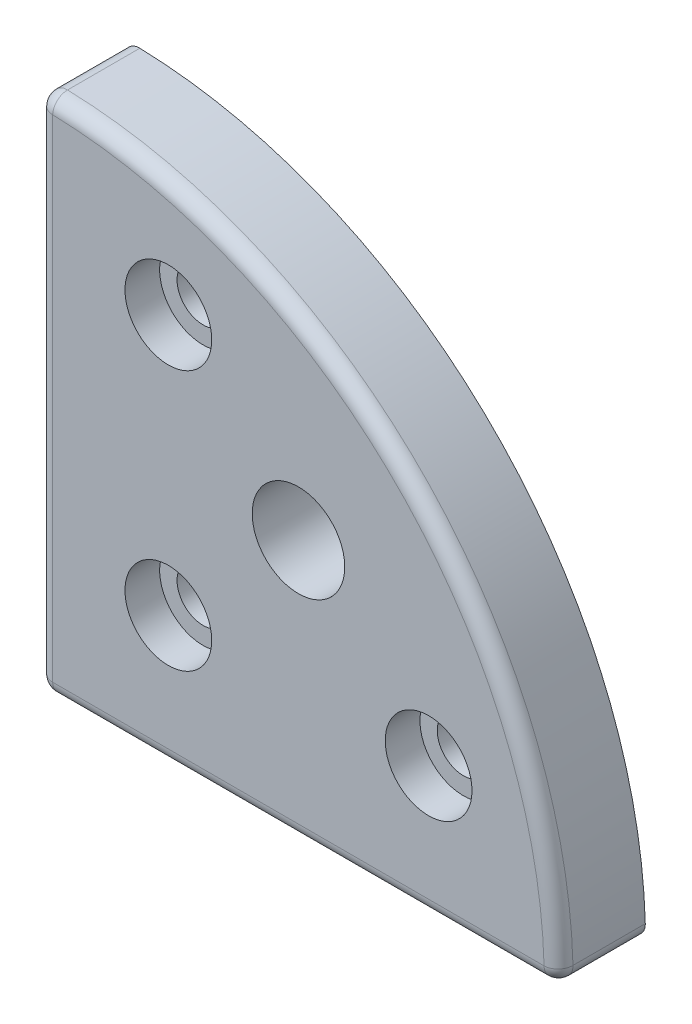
ISO-10303-21;
HEADER;
FILE_DESCRIPTION(('STEP AP214'),'2;1');
FILE_NAME('part.step','',(''),(''),'','','');
FILE_SCHEMA(('AUTOMOTIVE_DESIGN { 1 0 10303 214 1 1 1 1 }'));
ENDSEC;
DATA;
#1=APPLICATION_CONTEXT('core data for automotive mechanical design processes');
#2=APPLICATION_PROTOCOL_DEFINITION('international standard','automotive_design',2000,#1);
#3=PRODUCT_CONTEXT('',#1,'mechanical');
#4=PRODUCT('Part','Part','',(#3));
#5=PRODUCT_RELATED_PRODUCT_CATEGORY('part','',(#4));
#6=PRODUCT_DEFINITION_FORMATION('','',#4);
#7=PRODUCT_DEFINITION_CONTEXT('part definition',#1,'design');
#8=PRODUCT_DEFINITION('design','',#6,#7);
#9=PRODUCT_DEFINITION_SHAPE('','',#8);
#10=(LENGTH_UNIT() NAMED_UNIT(*) SI_UNIT(.MILLI.,.METRE.));
#11=(NAMED_UNIT(*) PLANE_ANGLE_UNIT() SI_UNIT($,.RADIAN.));
#12=(NAMED_UNIT(*) SI_UNIT($,.STERADIAN.) SOLID_ANGLE_UNIT());
#13=UNCERTAINTY_MEASURE_WITH_UNIT(LENGTH_MEASURE(1.E-05),#10,'distance_accuracy_value','');
#14=(GEOMETRIC_REPRESENTATION_CONTEXT(3) GLOBAL_UNCERTAINTY_ASSIGNED_CONTEXT((#13)) GLOBAL_UNIT_ASSIGNED_CONTEXT((#10,
#11,#12)) REPRESENTATION_CONTEXT('',''));
#15=CARTESIAN_POINT('',(0.,0.,0.));
#16=DIRECTION('',(0.,0.,1.));
#17=DIRECTION('',(1.,0.,0.));
#18=AXIS2_PLACEMENT_3D('',#15,#16,#17);
#19=CARTESIAN_POINT('',(65.9103992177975,51.8447142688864,9.));
#20=DIRECTION('',(0.,0.,1.));
#21=DIRECTION('',(1.,0.,0.));
#22=AXIS2_PLACEMENT_3D('',#19,#20,#21);
#23=CYLINDRICAL_SURFACE('',#22,7.5);
#24=CARTESIAN_POINT('',(65.9103992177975,51.8447142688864,9.));
#25=DIRECTION('',(0.,0.,1.));
#26=DIRECTION('',(1.,0.,0.));
#27=AXIS2_PLACEMENT_3D('',#24,#25,#26);
#28=CIRCLE('',#27,7.5);
#29=CARTESIAN_POINT('',(73.4103992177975,51.8447142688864,9.));
#30=VERTEX_POINT('',#29);
#31=EDGE_CURVE('E150',#30,#30,#28,.T.);
#32=ORIENTED_EDGE('',*,*,#31,.F.);
#33=EDGE_LOOP('',(#32));
#34=FACE_BOUND('',#33,.T.);
#35=CARTESIAN_POINT('',(65.9103992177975,51.8447142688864,15.));
#36=DIRECTION('',(0.,0.,1.));
#37=DIRECTION('',(1.,0.,0.));
#38=AXIS2_PLACEMENT_3D('',#35,#36,#37);
#39=CIRCLE('',#38,7.5);
#40=CARTESIAN_POINT('',(73.4103992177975,51.8447142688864,15.));
#41=VERTEX_POINT('',#40);
#42=EDGE_CURVE('E159',#41,#41,#39,.F.);
#43=ORIENTED_EDGE('',*,*,#42,.F.);
#44=EDGE_LOOP('',(#43));
#45=FACE_BOUND('',#44,.T.);
#46=ADVANCED_FACE('F15',(#34,#45),#23,.F.);
#47=CARTESIAN_POINT('',(20.9103992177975,51.8447142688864,9.));
#48=DIRECTION('',(0.,0.,1.));
#49=DIRECTION('',(1.,0.,0.));
#50=AXIS2_PLACEMENT_3D('',#47,#48,#49);
#51=CYLINDRICAL_SURFACE('',#50,7.5);
#52=CARTESIAN_POINT('',(20.9103992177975,51.8447142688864,9.));
#53=DIRECTION('',(0.,0.,1.));
#54=DIRECTION('',(1.,0.,0.));
#55=AXIS2_PLACEMENT_3D('',#52,#53,#54);
#56=CIRCLE('',#55,7.5);
#57=CARTESIAN_POINT('',(28.4103992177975,51.8447142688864,9.));
#58=VERTEX_POINT('',#57);
#59=EDGE_CURVE('E147',#58,#58,#56,.T.);
#60=ORIENTED_EDGE('',*,*,#59,.F.);
#61=EDGE_LOOP('',(#60));
#62=FACE_BOUND('',#61,.T.);
#63=CARTESIAN_POINT('',(20.9103992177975,51.8447142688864,15.));
#64=DIRECTION('',(0.,0.,1.));
#65=DIRECTION('',(1.,0.,0.));
#66=AXIS2_PLACEMENT_3D('',#63,#64,#65);
#67=CIRCLE('',#66,7.5);
#68=CARTESIAN_POINT('',(28.4103992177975,51.8447142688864,15.));
#69=VERTEX_POINT('',#68);
#70=EDGE_CURVE('E156',#69,#69,#67,.F.);
#71=ORIENTED_EDGE('',*,*,#70,.F.);
#72=EDGE_LOOP('',(#71));
#73=FACE_BOUND('',#72,.T.);
#74=ADVANCED_FACE('F432',(#62,#73),#51,.F.);
#75=CARTESIAN_POINT('',(20.9103992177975,96.8447142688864,9.));
#76=DIRECTION('',(0.,0.,1.));
#77=DIRECTION('',(1.,0.,0.));
#78=AXIS2_PLACEMENT_3D('',#75,#76,#77);
#79=CYLINDRICAL_SURFACE('',#78,7.5);
#80=CARTESIAN_POINT('',(20.9103992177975,96.8447142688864,9.));
#81=DIRECTION('',(0.,0.,1.));
#82=DIRECTION('',(1.,0.,0.));
#83=AXIS2_PLACEMENT_3D('',#80,#81,#82);
#84=CIRCLE('',#83,7.5);
#85=CARTESIAN_POINT('',(28.4103992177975,96.8447142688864,9.));
#86=VERTEX_POINT('',#85);
#87=EDGE_CURVE('E143',#86,#86,#84,.T.);
#88=ORIENTED_EDGE('',*,*,#87,.F.);
#89=EDGE_LOOP('',(#88));
#90=FACE_BOUND('',#89,.T.);
#91=CARTESIAN_POINT('',(20.9103992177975,96.8447142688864,15.));
#92=DIRECTION('',(0.,0.,1.));
#93=DIRECTION('',(1.,0.,0.));
#94=AXIS2_PLACEMENT_3D('',#91,#92,#93);
#95=CIRCLE('',#94,7.5);
#96=CARTESIAN_POINT('',(28.4103992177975,96.8447142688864,15.));
#97=VERTEX_POINT('',#96);
#98=EDGE_CURVE('E153',#97,#97,#95,.F.);
#99=ORIENTED_EDGE('',*,*,#98,.F.);
#100=EDGE_LOOP('',(#99));
#101=FACE_BOUND('',#100,.T.);
#102=ADVANCED_FACE('F426',(#90,#101),#79,.F.);
#103=CARTESIAN_POINT('',(0.910399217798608,49.292880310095,12.5));
#104=DIRECTION('',(0.,1.,0.));
#105=DIRECTION('',(-1.,0.,0.));
#106=AXIS2_PLACEMENT_3D('',#103,#104,#105);
#107=CYLINDRICAL_SURFACE('',#106,2.5);
#108=CARTESIAN_POINT('',(0.910399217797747,116.808992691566,12.5));
#109=DIRECTION('',(0.,1.,0.));
#110=DIRECTION('',(-1.,0.,0.));
#111=AXIS2_PLACEMENT_3D('',#108,#109,#110);
#112=CIRCLE('',#111,2.5);
#113=CARTESIAN_POINT('',(-1.58960078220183,116.808992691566,12.5));
#114=VERTEX_POINT('',#113);
#115=CARTESIAN_POINT('',(0.910399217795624,116.808992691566,15.));
#116=VERTEX_POINT('',#115);
#117=EDGE_CURVE('E71',#114,#116,#112,.T.);
#118=ORIENTED_EDGE('',*,*,#117,.F.);
#119=DIRECTION('',(0.,1.,0.));
#120=VECTOR('',#119,1.);
#121=CARTESIAN_POINT('',(-1.58960078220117,31.8447142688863,12.5));
#122=LINE('',#121,#120);
#123=CARTESIAN_POINT('',(-1.58960078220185,31.8447142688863,12.5));
#124=VERTEX_POINT('',#123);
#125=EDGE_CURVE('E146',#124,#114,#122,.T.);
#126=ORIENTED_EDGE('',*,*,#125,.F.);
#127=CARTESIAN_POINT('',(0.910399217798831,31.8447142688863,12.5));
#128=DIRECTION('',(0.,1.,0.));
#129=DIRECTION('',(-1.,0.,0.));
#130=AXIS2_PLACEMENT_3D('',#127,#128,#129);
#131=CIRCLE('',#130,2.5);
#132=CARTESIAN_POINT('',(0.910399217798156,31.8447142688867,15.));
#133=VERTEX_POINT('',#132);
#134=EDGE_CURVE('E18',#133,#124,#131,.F.);
#135=ORIENTED_EDGE('',*,*,#134,.F.);
#136=DIRECTION('',(0.,1.,0.));
#137=VECTOR('',#136,1.);
#138=CARTESIAN_POINT('',(0.910399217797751,66.741046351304,15.));
#139=LINE('',#138,#137);
#140=EDGE_CURVE('E162',#116,#133,#139,.F.);
#141=ORIENTED_EDGE('',*,*,#140,.F.);
#142=EDGE_LOOP('',(#118,#126,#135,#141));
#143=FACE_BOUND('',#142,.T.);
#144=ADVANCED_FACE('F186',(#143),#107,.T.);
#145=CARTESIAN_POINT('',(0.910399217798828,31.8447142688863,12.5));
#146=DIRECTION('',(-0.707106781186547,0.707106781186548,0.));
#147=DIRECTION('',(-0.707106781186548,-0.707106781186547,0.));
#148=AXIS2_PLACEMENT_3D('',#145,#146,#147);
#149=SPHERICAL_SURFACE('',#148,2.5);
#150=CARTESIAN_POINT('',(0.910399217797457,31.8447142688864,12.5));
#151=DIRECTION('',(0.,0.,1.));
#152=DIRECTION('',(1.,0.,0.));
#153=AXIS2_PLACEMENT_3D('',#150,#151,#152);
#154=CIRCLE('',#153,2.5);
#155=CARTESIAN_POINT('',(0.910399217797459,29.3447142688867,12.5));
#156=VERTEX_POINT('',#155);
#157=EDGE_CURVE('E183',#156,#124,#154,.F.);
#158=ORIENTED_EDGE('',*,*,#157,.F.);
#159=CARTESIAN_POINT('',(0.910399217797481,31.8447142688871,12.5));
#160=DIRECTION('',(-1.,0.,0.));
#161=DIRECTION('',(0.,-1.,0.));
#162=AXIS2_PLACEMENT_3D('',#159,#160,#161);
#163=CIRCLE('',#162,2.5);
#164=EDGE_CURVE('E177',#133,#156,#163,.F.);
#165=ORIENTED_EDGE('',*,*,#164,.F.);
#166=ORIENTED_EDGE('',*,*,#134,.T.);
#167=EDGE_LOOP('',(#158,#165,#166));
#168=FACE_BOUND('',#167,.T.);
#169=ADVANCED_FACE('F182',(#168),#149,.T.);
#170=CARTESIAN_POINT('',(60.8407044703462,31.8447142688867,12.5));
#171=DIRECTION('',(-1.,0.,0.));
#172=DIRECTION('',(0.,-1.,0.));
#173=AXIS2_PLACEMENT_3D('',#170,#171,#172);
#174=CYLINDRICAL_SURFACE('',#173,2.5);
#175=ORIENTED_EDGE('',*,*,#164,.T.);
#176=DIRECTION('',(1.,0.,0.));
#177=VECTOR('',#176,1.);
#178=CARTESIAN_POINT('',(85.8746776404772,29.3447142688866,12.5));
#179=LINE('',#178,#177);
#180=CARTESIAN_POINT('',(85.8746776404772,29.3447142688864,12.5));
#181=VERTEX_POINT('',#180);
#182=EDGE_CURVE('E97',#181,#156,#179,.F.);
#183=ORIENTED_EDGE('',*,*,#182,.F.);
#184=CARTESIAN_POINT('',(85.8746776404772,31.8447142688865,12.5));
#185=DIRECTION('',(-1.,0.,0.));
#186=DIRECTION('',(0.,-1.,0.));
#187=AXIS2_PLACEMENT_3D('',#184,#185,#186);
#188=CIRCLE('',#187,2.5);
#189=CARTESIAN_POINT('',(85.8746776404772,31.8447142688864,15.));
#190=VERTEX_POINT('',#189);
#191=EDGE_CURVE('E173',#190,#181,#188,.F.);
#192=ORIENTED_EDGE('',*,*,#191,.F.);
#193=DIRECTION('',(1.,0.,0.));
#194=VECTOR('',#193,1.);
#195=CARTESIAN_POINT('',(35.8067313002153,31.8447142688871,15.));
#196=LINE('',#195,#194);
#197=EDGE_CURVE('E164',#133,#190,#196,.T.);
#198=ORIENTED_EDGE('',*,*,#197,.F.);
#199=EDGE_LOOP('',(#175,#183,#192,#198));
#200=FACE_BOUND('',#199,.T.);
#201=ADVANCED_FACE('F240',(#200),#174,.T.);
#202=CARTESIAN_POINT('',(85.8746776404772,31.8447142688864,12.5));
#203=DIRECTION('',(-0.707106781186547,0.707106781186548,0.));
#204=DIRECTION('',(-0.707106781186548,-0.707106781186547,0.));
#205=AXIS2_PLACEMENT_3D('',#202,#203,#204);
#206=SPHERICAL_SURFACE('',#205,2.5);
#207=CARTESIAN_POINT('',(85.8746776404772,31.8447142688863,12.5));
#208=DIRECTION('',(0.,0.,1.));
#209=DIRECTION('',(1.,0.,0.));
#210=AXIS2_PLACEMENT_3D('',#207,#208,#209);
#211=CIRCLE('',#210,2.5);
#212=CARTESIAN_POINT('',(88.3736570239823,31.916142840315,12.5));
#213=VERTEX_POINT('',#212);
#214=CARTESIAN_POINT('',(87.6424445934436,30.07694731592,12.5));
#215=VERTEX_POINT('',#214);
#216=EDGE_CURVE('E33',#213,#215,#211,.F.);
#217=ORIENTED_EDGE('',*,*,#216,.F.);
#218=CARTESIAN_POINT('',(85.8746776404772,31.8447142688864,12.5));
#219=DIRECTION('',(0.0285714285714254,-0.999591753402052,0.));
#220=DIRECTION('',(0.999591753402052,0.0285714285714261,0.));
#221=AXIS2_PLACEMENT_3D('',#218,#219,#220);
#222=CIRCLE('',#221,2.5);
#223=EDGE_CURVE('E169',#190,#213,#222,.F.);
#224=ORIENTED_EDGE('',*,*,#223,.F.);
#225=ORIENTED_EDGE('',*,*,#191,.T.);
#226=CARTESIAN_POINT('',(85.8746776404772,31.8447142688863,12.5));
#227=DIRECTION('',(0.,0.,1.));
#228=DIRECTION('',(1.,0.,0.));
#229=AXIS2_PLACEMENT_3D('',#226,#227,#228);
#230=CIRCLE('',#229,2.5);
#231=EDGE_CURVE('E140',#215,#181,#230,.F.);
#232=ORIENTED_EDGE('',*,*,#231,.F.);
#233=EDGE_LOOP('',(#217,#224,#225,#232));
#234=FACE_BOUND('',#233,.T.);
#235=ADVANCED_FACE('F237',(#234),#206,.T.);
#236=CARTESIAN_POINT('',(-1.58960078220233,29.3447142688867,12.5));
#237=DIRECTION('',(0.,0.,-1.));
#238=DIRECTION('',(0.707106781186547,-0.707106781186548,0.));
#239=AXIS2_PLACEMENT_3D('',#236,#237,#238);
#240=TOROIDAL_SURFACE('',#239,87.5,2.5);
#241=ORIENTED_EDGE('',*,*,#223,.T.);
#242=CARTESIAN_POINT('',(-1.58960078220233,29.3447142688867,12.5));
#243=DIRECTION('',(0.,0.,1.));
#244=DIRECTION('',(1.,0.,0.));
#245=AXIS2_PLACEMENT_3D('',#242,#243,#244);
#246=CIRCLE('',#245,90.);
#247=CARTESIAN_POINT('',(0.981827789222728,119.307972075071,12.5));
#248=VERTEX_POINT('',#247);
#249=EDGE_CURVE('E231',#248,#213,#246,.F.);
#250=ORIENTED_EDGE('',*,*,#249,.F.);
#251=CARTESIAN_POINT('',(0.910399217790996,116.808992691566,12.5));
#252=DIRECTION('',(0.999591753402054,-0.0285714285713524,0.));
#253=DIRECTION('',(0.0285714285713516,0.999591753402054,0.));
#254=AXIS2_PLACEMENT_3D('',#251,#252,#253);
#255=CIRCLE('',#254,2.5);
#256=EDGE_CURVE('E165',#116,#248,#255,.F.);
#257=ORIENTED_EDGE('',*,*,#256,.F.);
#258=CARTESIAN_POINT('',(-1.58960078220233,29.3447142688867,15.));
#259=DIRECTION('',(0.,0.,-1.));
#260=DIRECTION('',(0.0285714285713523,0.999591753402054,0.));
#261=AXIS2_PLACEMENT_3D('',#258,#259,#260);
#262=CIRCLE('',#261,87.4999999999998);
#263=EDGE_CURVE('E200',#190,#116,#262,.F.);
#264=ORIENTED_EDGE('',*,*,#263,.F.);
#265=EDGE_LOOP('',(#241,#250,#257,#264));
#266=FACE_BOUND('',#265,.T.);
#267=ADVANCED_FACE('F224',(#266),#240,.T.);
#268=CARTESIAN_POINT('',(0.910399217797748,116.808992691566,12.5));
#269=DIRECTION('',(-0.707106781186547,0.707106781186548,0.));
#270=DIRECTION('',(-0.707106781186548,-0.707106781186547,0.));
#271=AXIS2_PLACEMENT_3D('',#268,#269,#270);
#272=SPHERICAL_SURFACE('',#271,2.5);
#273=CARTESIAN_POINT('',(0.910399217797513,116.808992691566,12.5));
#274=DIRECTION('',(0.,0.,1.));
#275=DIRECTION('',(1.,0.,0.));
#276=AXIS2_PLACEMENT_3D('',#273,#274,#275);
#277=CIRCLE('',#276,2.5);
#278=CARTESIAN_POINT('',(-0.857367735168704,118.576759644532,12.5));
#279=VERTEX_POINT('',#278);
#280=EDGE_CURVE('E139',#114,#279,#277,.F.);
#281=ORIENTED_EDGE('',*,*,#280,.F.);
#282=ORIENTED_EDGE('',*,*,#117,.T.);
#283=ORIENTED_EDGE('',*,*,#256,.T.);
#284=CARTESIAN_POINT('',(0.910399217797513,116.808992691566,12.5));
#285=DIRECTION('',(0.,0.,1.));
#286=DIRECTION('',(1.,0.,0.));
#287=AXIS2_PLACEMENT_3D('',#284,#285,#286);
#288=CIRCLE('',#287,2.5);
#289=EDGE_CURVE('E135',#279,#248,#288,.F.);
#290=ORIENTED_EDGE('',*,*,#289,.F.);
#291=EDGE_LOOP('',(#281,#282,#283,#290));
#292=FACE_BOUND('',#291,.T.);
#293=ADVANCED_FACE('F218',(#292),#272,.T.);
#294=CARTESIAN_POINT('',(35.8067313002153,66.741046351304,15.));
#295=DIRECTION('',(0.,0.,1.));
#296=DIRECTION('',(1.,0.,0.));
#297=AXIS2_PLACEMENT_3D('',#294,#295,#296);
#298=PLANE('',#297);
#299=ORIENTED_EDGE('',*,*,#98,.T.);
#300=EDGE_LOOP('',(#299));
#301=FACE_BOUND('',#300,.T.);
#302=ORIENTED_EDGE('',*,*,#70,.T.);
#303=EDGE_LOOP('',(#302));
#304=FACE_BOUND('',#303,.T.);
#305=ORIENTED_EDGE('',*,*,#42,.T.);
#306=EDGE_LOOP('',(#305));
#307=FACE_BOUND('',#306,.T.);
#308=CARTESIAN_POINT('',(43.4103992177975,74.3447142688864,15.));
#309=DIRECTION('',(0.,0.,1.));
#310=DIRECTION('',(1.,0.,0.));
#311=AXIS2_PLACEMENT_3D('',#308,#309,#310);
#312=CIRCLE('',#311,8.);
#313=CARTESIAN_POINT('',(51.4103992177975,74.3447142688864,15.));
#314=VERTEX_POINT('',#313);
#315=EDGE_CURVE('E131',#314,#314,#312,.F.);
#316=ORIENTED_EDGE('',*,*,#315,.T.);
#317=EDGE_LOOP('',(#316));
#318=FACE_BOUND('',#317,.T.);
#319=ORIENTED_EDGE('',*,*,#263,.T.);
#320=ORIENTED_EDGE('',*,*,#140,.T.);
#321=ORIENTED_EDGE('',*,*,#197,.T.);
#322=EDGE_LOOP('',(#319,#320,#321));
#323=FACE_BOUND('',#322,.T.);
#324=ADVANCED_FACE('F207',(#301,#304,#307,#318,#323),#298,.T.);
#325=CARTESIAN_POINT('',(65.9103992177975,51.8447142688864,9.));
#326=DIRECTION('',(0.,0.,1.));
#327=DIRECTION('',(1.,0.,0.));
#328=AXIS2_PLACEMENT_3D('',#325,#326,#327);
#329=PLANE('',#328);
#330=CARTESIAN_POINT('',(65.9103992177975,51.8447142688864,9.));
#331=DIRECTION('',(0.,0.,1.));
#332=DIRECTION('',(1.,0.,0.));
#333=AXIS2_PLACEMENT_3D('',#330,#331,#332);
#334=CIRCLE('',#333,4.5);
#335=CARTESIAN_POINT('',(70.4103992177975,51.8447142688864,9.));
#336=VERTEX_POINT('',#335);
#337=EDGE_CURVE('E128',#336,#336,#334,.F.);
#338=ORIENTED_EDGE('',*,*,#337,.T.);
#339=EDGE_LOOP('',(#338));
#340=FACE_BOUND('',#339,.T.);
#341=ORIENTED_EDGE('',*,*,#31,.T.);
#342=EDGE_LOOP('',(#341));
#343=FACE_BOUND('',#342,.T.);
#344=ADVANCED_FACE('F217',(#340,#343),#329,.T.);
#345=CARTESIAN_POINT('',(20.9103992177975,51.8447142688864,9.));
#346=DIRECTION('',(0.,0.,1.));
#347=DIRECTION('',(1.,0.,0.));
#348=AXIS2_PLACEMENT_3D('',#345,#346,#347);
#349=PLANE('',#348);
#350=CARTESIAN_POINT('',(20.9103992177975,51.8447142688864,9.));
#351=DIRECTION('',(0.,0.,1.));
#352=DIRECTION('',(1.,0.,0.));
#353=AXIS2_PLACEMENT_3D('',#350,#351,#352);
#354=CIRCLE('',#353,4.5);
#355=CARTESIAN_POINT('',(25.4103992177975,51.8447142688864,9.));
#356=VERTEX_POINT('',#355);
#357=EDGE_CURVE('E125',#356,#356,#354,.F.);
#358=ORIENTED_EDGE('',*,*,#357,.T.);
#359=EDGE_LOOP('',(#358));
#360=FACE_BOUND('',#359,.T.);
#361=ORIENTED_EDGE('',*,*,#59,.T.);
#362=EDGE_LOOP('',(#361));
#363=FACE_BOUND('',#362,.T.);
#364=ADVANCED_FACE('F381',(#360,#363),#349,.T.);
#365=CARTESIAN_POINT('',(20.9103992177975,96.8447142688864,9.));
#366=DIRECTION('',(0.,0.,1.));
#367=DIRECTION('',(1.,0.,0.));
#368=AXIS2_PLACEMENT_3D('',#365,#366,#367);
#369=PLANE('',#368);
#370=CARTESIAN_POINT('',(20.9103992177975,96.8447142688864,9.));
#371=DIRECTION('',(0.,0.,1.));
#372=DIRECTION('',(1.,0.,0.));
#373=AXIS2_PLACEMENT_3D('',#370,#371,#372);
#374=CIRCLE('',#373,4.5);
#375=CARTESIAN_POINT('',(25.4103992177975,96.8447142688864,9.));
#376=VERTEX_POINT('',#375);
#377=EDGE_CURVE('E118',#376,#376,#374,.F.);
#378=ORIENTED_EDGE('',*,*,#377,.T.);
#379=EDGE_LOOP('',(#378));
#380=FACE_BOUND('',#379,.T.);
#381=ORIENTED_EDGE('',*,*,#87,.T.);
#382=EDGE_LOOP('',(#381));
#383=FACE_BOUND('',#382,.T.);
#384=ADVANCED_FACE('F374',(#380,#383),#369,.T.);
#385=CARTESIAN_POINT('',(-1.58960078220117,31.8447142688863,0.));
#386=DIRECTION('',(-1.,0.,0.));
#387=DIRECTION('',(0.,0.,1.));
#388=AXIS2_PLACEMENT_3D('',#385,#386,#387);
#389=PLANE('',#388);
#390=DIRECTION('',(0.,1.,0.));
#391=VECTOR('',#390,1.);
#392=CARTESIAN_POINT('',(-1.58960078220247,66.741046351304,0.));
#393=LINE('',#392,#391);
#394=CARTESIAN_POINT('',(-1.58960078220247,116.808992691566,0.));
#395=VERTEX_POINT('',#394);
#396=CARTESIAN_POINT('',(-1.5896007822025,31.8447142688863,0.));
#397=VERTEX_POINT('',#396);
#398=EDGE_CURVE('E116',#395,#397,#393,.F.);
#399=ORIENTED_EDGE('',*,*,#398,.T.);
#400=DIRECTION('',(0.,0.,1.));
#401=VECTOR('',#400,1.);
#402=CARTESIAN_POINT('',(-1.58960078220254,31.8447142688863,0.));
#403=LINE('',#402,#401);
#404=EDGE_CURVE('E115',#124,#397,#403,.F.);
#405=ORIENTED_EDGE('',*,*,#404,.F.);
#406=ORIENTED_EDGE('',*,*,#125,.T.);
#407=DIRECTION('',(0.,0.,1.));
#408=VECTOR('',#407,1.);
#409=CARTESIAN_POINT('',(-1.58960078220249,116.808992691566,0.));
#410=LINE('',#409,#408);
#411=EDGE_CURVE('E134',#395,#114,#410,.T.);
#412=ORIENTED_EDGE('',*,*,#411,.F.);
#413=EDGE_LOOP('',(#399,#405,#406,#412));
#414=FACE_BOUND('',#413,.T.);
#415=ADVANCED_FACE('F190',(#414),#389,.T.);
#416=CARTESIAN_POINT('',(0.910399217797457,31.8447142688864,0.));
#417=DIRECTION('',(0.,0.,1.));
#418=DIRECTION('',(1.,0.,0.));
#419=AXIS2_PLACEMENT_3D('',#416,#417,#418);
#420=CYLINDRICAL_SURFACE('',#419,2.5);
#421=CARTESIAN_POINT('',(0.910399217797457,31.8447142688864,0.));
#422=DIRECTION('',(0.,0.,1.));
#423=DIRECTION('',(1.,0.,0.));
#424=AXIS2_PLACEMENT_3D('',#421,#422,#423);
#425=CIRCLE('',#424,2.5);
#426=CARTESIAN_POINT('',(0.910399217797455,29.3447142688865,0.));
#427=VERTEX_POINT('',#426);
#428=EDGE_CURVE('E108',#397,#427,#425,.T.);
#429=ORIENTED_EDGE('',*,*,#428,.T.);
#430=DIRECTION('',(0.,0.,-1.));
#431=VECTOR('',#430,1.);
#432=CARTESIAN_POINT('',(0.910399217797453,29.3447142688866,0.));
#433=LINE('',#432,#431);
#434=EDGE_CURVE('E91',#156,#427,#433,.T.);
#435=ORIENTED_EDGE('',*,*,#434,.F.);
#436=ORIENTED_EDGE('',*,*,#157,.T.);
#437=ORIENTED_EDGE('',*,*,#404,.T.);
#438=EDGE_LOOP('',(#429,#435,#436,#437));
#439=FACE_BOUND('',#438,.T.);
#440=ADVANCED_FACE('F113',(#439),#420,.T.);
#441=CARTESIAN_POINT('',(85.8746776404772,29.3447142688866,0.));
#442=DIRECTION('',(0.,-1.,0.));
#443=DIRECTION('',(0.,0.,-1.));
#444=AXIS2_PLACEMENT_3D('',#441,#442,#443);
#445=PLANE('',#444);
#446=DIRECTION('',(1.,0.,0.));
#447=VECTOR('',#446,1.);
#448=CARTESIAN_POINT('',(35.8067313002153,29.3447142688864,0.));
#449=LINE('',#448,#447);
#450=CARTESIAN_POINT('',(85.8746776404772,29.3447142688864,0.));
#451=VERTEX_POINT('',#450);
#452=EDGE_CURVE('E95',#427,#451,#449,.T.);
#453=ORIENTED_EDGE('',*,*,#452,.T.);
#454=DIRECTION('',(0.,0.,1.));
#455=VECTOR('',#454,1.);
#456=CARTESIAN_POINT('',(85.8746776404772,29.3447142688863,0.));
#457=LINE('',#456,#455);
#458=EDGE_CURVE('E142',#181,#451,#457,.F.);
#459=ORIENTED_EDGE('',*,*,#458,.F.);
#460=ORIENTED_EDGE('',*,*,#182,.T.);
#461=ORIENTED_EDGE('',*,*,#434,.T.);
#462=EDGE_LOOP('',(#453,#459,#460,#461));
#463=FACE_BOUND('',#462,.T.);
#464=ADVANCED_FACE('F93',(#463),#445,.T.);
#465=CARTESIAN_POINT('',(85.8746776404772,31.8447142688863,0.));
#466=DIRECTION('',(0.,0.,1.));
#467=DIRECTION('',(1.,0.,0.));
#468=AXIS2_PLACEMENT_3D('',#465,#466,#467);
#469=CYLINDRICAL_SURFACE('',#468,2.5);
#470=CARTESIAN_POINT('',(85.8746776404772,31.8447142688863,0.));
#471=DIRECTION('',(0.,0.,1.));
#472=DIRECTION('',(1.,0.,0.));
#473=AXIS2_PLACEMENT_3D('',#470,#471,#472);
#474=CIRCLE('',#473,2.5);
#475=CARTESIAN_POINT('',(88.3736570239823,31.916142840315,0.));
#476=VERTEX_POINT('',#475);
#477=EDGE_CURVE('E111',#451,#476,#474,.T.);
#478=ORIENTED_EDGE('',*,*,#477,.T.);
#479=DIRECTION('',(0.,0.,1.));
#480=VECTOR('',#479,1.);
#481=CARTESIAN_POINT('',(88.3736570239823,31.916142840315,0.));
#482=LINE('',#481,#480);
#483=EDGE_CURVE('E274',#213,#476,#482,.F.);
#484=ORIENTED_EDGE('',*,*,#483,.F.);
#485=ORIENTED_EDGE('',*,*,#216,.T.);
#486=ORIENTED_EDGE('',*,*,#231,.T.);
#487=ORIENTED_EDGE('',*,*,#458,.T.);
#488=EDGE_LOOP('',(#478,#484,#485,#486,#487));
#489=FACE_BOUND('',#488,.T.);
#490=ADVANCED_FACE('F273',(#489),#469,.T.);
#491=CARTESIAN_POINT('',(-1.58960078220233,29.3447142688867,0.));
#492=DIRECTION('',(0.,0.,1.));
#493=DIRECTION('',(1.,0.,0.));
#494=AXIS2_PLACEMENT_3D('',#491,#492,#493);
#495=CYLINDRICAL_SURFACE('',#494,90.);
#496=CARTESIAN_POINT('',(-1.58960078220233,29.3447142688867,0.));
#497=DIRECTION('',(0.,0.,1.));
#498=DIRECTION('',(1.,0.,0.));
#499=AXIS2_PLACEMENT_3D('',#496,#497,#498);
#500=CIRCLE('',#499,90.);
#501=CARTESIAN_POINT('',(0.981827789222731,119.307972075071,0.));
#502=VERTEX_POINT('',#501);
#503=EDGE_CURVE('E269',#476,#502,#500,.T.);
#504=ORIENTED_EDGE('',*,*,#503,.T.);
#505=DIRECTION('',(0.,0.,1.));
#506=VECTOR('',#505,1.);
#507=CARTESIAN_POINT('',(0.981827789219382,119.307972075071,0.));
#508=LINE('',#507,#506);
#509=EDGE_CURVE('E138',#248,#502,#508,.F.);
#510=ORIENTED_EDGE('',*,*,#509,.F.);
#511=ORIENTED_EDGE('',*,*,#249,.T.);
#512=ORIENTED_EDGE('',*,*,#483,.T.);
#513=EDGE_LOOP('',(#504,#510,#511,#512));
#514=FACE_BOUND('',#513,.T.);
#515=ADVANCED_FACE('F286',(#514),#495,.T.);
#516=CARTESIAN_POINT('',(0.910399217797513,116.808992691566,0.));
#517=DIRECTION('',(0.,0.,1.));
#518=DIRECTION('',(1.,0.,0.));
#519=AXIS2_PLACEMENT_3D('',#516,#517,#518);
#520=CYLINDRICAL_SURFACE('',#519,2.5);
#521=CARTESIAN_POINT('',(0.910399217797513,116.808992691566,0.));
#522=DIRECTION('',(0.,0.,1.));
#523=DIRECTION('',(1.,0.,0.));
#524=AXIS2_PLACEMENT_3D('',#521,#522,#523);
#525=CIRCLE('',#524,2.5);
#526=EDGE_CURVE('E267',#502,#395,#525,.T.);
#527=ORIENTED_EDGE('',*,*,#526,.T.);
#528=ORIENTED_EDGE('',*,*,#411,.T.);
#529=ORIENTED_EDGE('',*,*,#280,.T.);
#530=ORIENTED_EDGE('',*,*,#289,.T.);
#531=ORIENTED_EDGE('',*,*,#509,.T.);
#532=EDGE_LOOP('',(#527,#528,#529,#530,#531));
#533=FACE_BOUND('',#532,.T.);
#534=ADVANCED_FACE('F282',(#533),#520,.T.);
#535=CARTESIAN_POINT('',(43.4103992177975,74.3447142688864,0.));
#536=DIRECTION('',(0.,0.,1.));
#537=DIRECTION('',(1.,0.,0.));
#538=AXIS2_PLACEMENT_3D('',#535,#536,#537);
#539=CYLINDRICAL_SURFACE('',#538,8.);
#540=CARTESIAN_POINT('',(43.4103992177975,74.3447142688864,0.));
#541=DIRECTION('',(0.,0.,1.));
#542=DIRECTION('',(1.,0.,0.));
#543=AXIS2_PLACEMENT_3D('',#540,#541,#542);
#544=CIRCLE('',#543,8.);
#545=CARTESIAN_POINT('',(51.4103992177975,74.3447142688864,0.));
#546=VERTEX_POINT('',#545);
#547=EDGE_CURVE('E264',#546,#546,#544,.F.);
#548=ORIENTED_EDGE('',*,*,#547,.T.);
#549=EDGE_LOOP('',(#548));
#550=FACE_BOUND('',#549,.T.);
#551=ORIENTED_EDGE('',*,*,#315,.F.);
#552=EDGE_LOOP('',(#551));
#553=FACE_BOUND('',#552,.T.);
#554=ADVANCED_FACE('F294',(#550,#553),#539,.F.);
#555=CARTESIAN_POINT('',(65.9103992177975,51.8447142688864,0.));
#556=DIRECTION('',(0.,0.,1.));
#557=DIRECTION('',(1.,0.,0.));
#558=AXIS2_PLACEMENT_3D('',#555,#556,#557);
#559=CYLINDRICAL_SURFACE('',#558,4.5);
#560=CARTESIAN_POINT('',(65.9103992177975,51.8447142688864,0.));
#561=DIRECTION('',(0.,0.,1.));
#562=DIRECTION('',(1.,0.,0.));
#563=AXIS2_PLACEMENT_3D('',#560,#561,#562);
#564=CIRCLE('',#563,4.5);
#565=CARTESIAN_POINT('',(70.4103992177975,51.8447142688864,0.));
#566=VERTEX_POINT('',#565);
#567=EDGE_CURVE('E261',#566,#566,#564,.F.);
#568=ORIENTED_EDGE('',*,*,#567,.T.);
#569=EDGE_LOOP('',(#568));
#570=FACE_BOUND('',#569,.T.);
#571=ORIENTED_EDGE('',*,*,#337,.F.);
#572=EDGE_LOOP('',(#571));
#573=FACE_BOUND('',#572,.T.);
#574=ADVANCED_FACE('F312',(#570,#573),#559,.F.);
#575=CARTESIAN_POINT('',(20.9103992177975,51.8447142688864,0.));
#576=DIRECTION('',(0.,0.,1.));
#577=DIRECTION('',(1.,0.,0.));
#578=AXIS2_PLACEMENT_3D('',#575,#576,#577);
#579=CYLINDRICAL_SURFACE('',#578,4.5);
#580=CARTESIAN_POINT('',(20.9103992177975,51.8447142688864,0.));
#581=DIRECTION('',(0.,0.,1.));
#582=DIRECTION('',(1.,0.,0.));
#583=AXIS2_PLACEMENT_3D('',#580,#581,#582);
#584=CIRCLE('',#583,4.5);
#585=CARTESIAN_POINT('',(25.4103992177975,51.8447142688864,0.));
#586=VERTEX_POINT('',#585);
#587=EDGE_CURVE('E24',#586,#586,#584,.F.);
#588=ORIENTED_EDGE('',*,*,#587,.T.);
#589=EDGE_LOOP('',(#588));
#590=FACE_BOUND('',#589,.T.);
#591=ORIENTED_EDGE('',*,*,#357,.F.);
#592=EDGE_LOOP('',(#591));
#593=FACE_BOUND('',#592,.T.);
#594=ADVANCED_FACE('F304',(#590,#593),#579,.F.);
#595=CARTESIAN_POINT('',(20.9103992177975,96.8447142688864,0.));
#596=DIRECTION('',(0.,0.,1.));
#597=DIRECTION('',(1.,0.,0.));
#598=AXIS2_PLACEMENT_3D('',#595,#596,#597);
#599=CYLINDRICAL_SURFACE('',#598,4.5);
#600=CARTESIAN_POINT('',(20.9103992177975,96.8447142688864,0.));
#601=DIRECTION('',(0.,0.,1.));
#602=DIRECTION('',(1.,0.,0.));
#603=AXIS2_PLACEMENT_3D('',#600,#601,#602);
#604=CIRCLE('',#603,4.5);
#605=CARTESIAN_POINT('',(25.4103992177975,96.8447142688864,0.));
#606=VERTEX_POINT('',#605);
#607=EDGE_CURVE('E10',#606,#606,#604,.F.);
#608=ORIENTED_EDGE('',*,*,#607,.T.);
#609=EDGE_LOOP('',(#608));
#610=FACE_BOUND('',#609,.T.);
#611=ORIENTED_EDGE('',*,*,#377,.F.);
#612=EDGE_LOOP('',(#611));
#613=FACE_BOUND('',#612,.T.);
#614=ADVANCED_FACE('F298',(#610,#613),#599,.F.);
#615=CARTESIAN_POINT('',(35.8067313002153,66.741046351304,0.));
#616=DIRECTION('',(0.,0.,1.));
#617=DIRECTION('',(1.,0.,0.));
#618=AXIS2_PLACEMENT_3D('',#615,#616,#617);
#619=PLANE('',#618);
#620=ORIENTED_EDGE('',*,*,#607,.F.);
#621=EDGE_LOOP('',(#620));
#622=FACE_BOUND('',#621,.T.);
#623=ORIENTED_EDGE('',*,*,#587,.F.);
#624=EDGE_LOOP('',(#623));
#625=FACE_BOUND('',#624,.T.);
#626=ORIENTED_EDGE('',*,*,#567,.F.);
#627=EDGE_LOOP('',(#626));
#628=FACE_BOUND('',#627,.T.);
#629=ORIENTED_EDGE('',*,*,#547,.F.);
#630=EDGE_LOOP('',(#629));
#631=FACE_BOUND('',#630,.T.);
#632=ORIENTED_EDGE('',*,*,#503,.F.);
#633=ORIENTED_EDGE('',*,*,#477,.F.);
#634=ORIENTED_EDGE('',*,*,#452,.F.);
#635=ORIENTED_EDGE('',*,*,#428,.F.);
#636=ORIENTED_EDGE('',*,*,#398,.F.);
#637=ORIENTED_EDGE('',*,*,#526,.F.);
#638=EDGE_LOOP('',(#632,#633,#634,#635,#636,#637));
#639=FACE_BOUND('',#638,.T.);
#640=ADVANCED_FACE('F107',(#622,#625,#628,#631,#639),#619,.F.);
#641=CLOSED_SHELL('',(#46,#74,#102,#144,#169,#201,#235,#267,#293,#324,#344,#364,#384,#415,#440,
#464,#490,#515,#534,#554,#574,#594,#614,#640));
#642=MANIFOLD_SOLID_BREP('B1',#641);
#643=ADVANCED_BREP_SHAPE_REPRESENTATION('',(#18,#642),#14);
#644=SHAPE_DEFINITION_REPRESENTATION(#9,#643);
ENDSEC;
END-ISO-10303-21;
